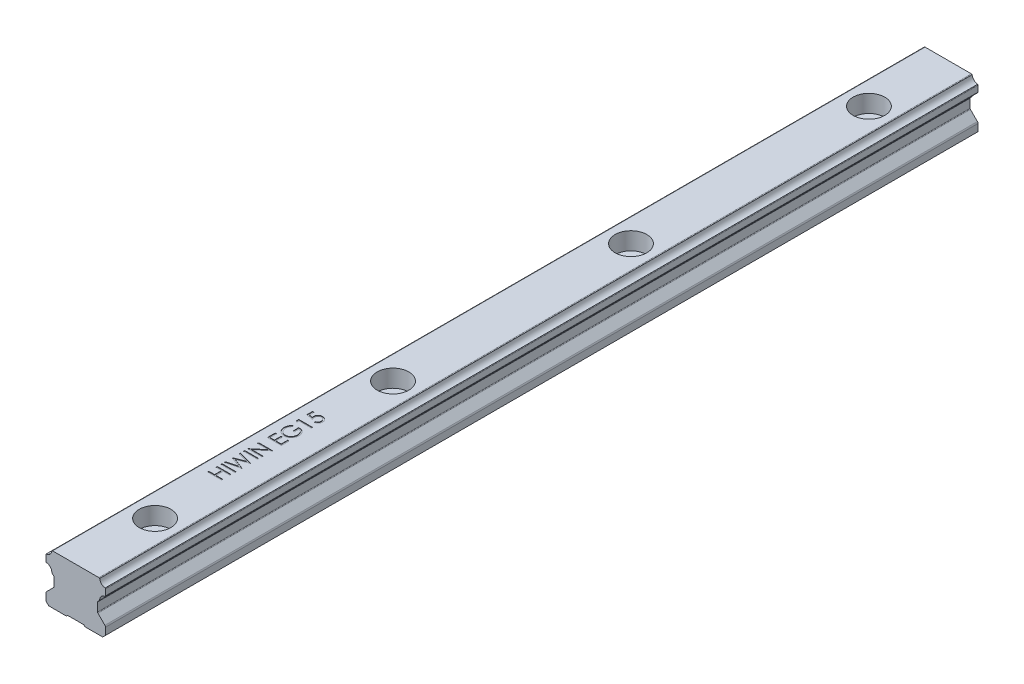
from build123d import *

# Parameters (mm, degrees)
EXTRUDE_1_DEPTH              = 220
HOLE_WIZARD_M4_1_D           = 4.5
HOLE_WIZARD_M4_1_CBORE_D     = 8
HOLE_WIZARD_M4_1_CBORE_DEPTH = 4.4
PATTERN_LINEAR_1_COUNT       = 4
PATTERN_LINEAR_1_PITCH       = 60
SKETCH_6_W                   = 3.5
SKETCH_6_H                   = 0.314102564
CUT_EXTRUDE_1_DEPTH          = 0.1


with BuildPart() as part:
    # Sketch 1 → Extrude 1 (new body)
    with BuildSketch(Plane.XY):
        with BuildLine():
            Line((7.5, 9.369442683), (7.5, 10.830565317))
            ThreePointArc((7.5, 10.830565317), (7.479698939, 10.939048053), (7.421543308, 11.032848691))
            ThreePointArc((7.421543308, 11.032848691), (6.468331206, 11.468335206), (6.03284469, 12.421547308))
            ThreePointArc((6.03284469, 12.421547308), (5.939044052, 12.479702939), (5.830561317, 12.500004))
            Line((5.830561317, 12.500004), (-5.830561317, 12.500004))
            ThreePointArc((-5.830561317, 12.500004), (-5.939044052, 12.479702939), (-6.03284469, 12.421547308))
            ThreePointArc((-6.03284469, 12.421547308), (-6.468331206, 11.468335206), (-7.421543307, 11.03284869))
            ThreePointArc((-7.421543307, 11.03284869), (-7.479698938, 10.939048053), (-7.5, 10.830565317))
            Line((-7.5, 10.830565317), (-7.5, 9.369442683))
            ThreePointArc((-7.5, 9.369442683), (-7.479698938, 9.260959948), (-7.421543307, 9.16715931))
            ThreePointArc((-7.421543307, 9.16715931), (-6.419021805, 8.6799564), (-6.029408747, 7.635629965))
            Line((-6.029408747, 7.635629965), (-5.58786755, 7.194087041))
            ThreePointArc((-5.58786755, 7.194087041), (-5.522836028, 7.09676018), (-5.5, 6.981955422))
            Line((-5.5, 6.981955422), (-5.5, 4.824263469))
            ThreePointArc((-5.5, 4.824263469), (-5.52283614, 4.709458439), (-5.587867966, 4.612131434))
            Line((-5.587867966, 4.612131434), (-7.353553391, 2.846446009))
            ThreePointArc((-7.353553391, 2.846446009), (-7.461939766, 2.684234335), (-7.5, 2.492892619))
            Line((-7.5, 2.492892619), (-7.5, 0.700010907))
            Line((-7.5, 0.700010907), (-6.79998907, 0))
            Line((-6.79998907, 0), (-2.3500088, 0))
            Line((-2.3500088, 0), (-2.05000999, 0.29999924))
            Line((-2.05000999, 0.29999924), (2.05000999, 0.29999924))
            Line((2.05000999, 0.29999924), (2.3500088, 0))
            Line((2.3500088, 0), (6.79998907, 0))
            Line((6.79998907, 0), (7.5, 0.700010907))
            Line((7.5, 0.700010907), (7.5, 2.492892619))
            ThreePointArc((7.5, 2.492892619), (7.461939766, 2.684234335), (7.353553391, 2.84644601))
            Line((7.353553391, 2.84644601), (5.587867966, 4.612131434))
            ThreePointArc((5.587867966, 4.612131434), (5.522836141, 4.709458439), (5.5, 4.824263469))
            Line((5.5, 4.824263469), (5.5, 6.981955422))
            ThreePointArc((5.5, 6.981955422), (5.522836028, 7.09676018), (5.587867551, 7.194087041))
            Line((5.587867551, 7.194087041), (6.029408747, 7.635629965))
            ThreePointArc((6.029408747, 7.635629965), (6.419021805, 8.6799564), (7.421543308, 9.16715931))
            ThreePointArc((7.421543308, 9.16715931), (7.479698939, 9.260959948), (7.5, 9.369442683))
        make_face()
    extrude(amount=-EXTRUDE_1_DEPTH)

    # Hole Wizard M4 _1 (through all)
    with Locations(Plane(origin=(1.396551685, 12.500004, 9.221659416), x_dir=(-1, 0, 0), z_dir=(0, 1, 0))):
        with Locations((1.396551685, -29.221659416)):
            hole_wizard_m4_1 = CounterBoreHole(HOLE_WIZARD_M4_1_D / 2, HOLE_WIZARD_M4_1_CBORE_D / 2, HOLE_WIZARD_M4_1_CBORE_DEPTH)

    # Pattern Linear 1: Hole Wizard M4 _1 ×4
    with Locations(*[(0, 0, -i * PATTERN_LINEAR_1_PITCH) for i in range(1, PATTERN_LINEAR_1_COUNT)]):
        add(hole_wizard_m4_1, mode=Mode.SUBTRACT)

    # Sketch 6 → Cut-Extrude 1 (cut)
    with BuildSketch(Plane(origin=(0, 12.500004, 0), x_dir=(1, 0, 0), z_dir=(0, 1, 0))):
        Polygon((-3.5, 36.762820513), (-3.5, 37.076923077), (-2.064102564, 37.076923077), (-2.064102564, 38.871794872), (-3.5, 38.871794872), (-3.5, 39.185897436), (0, 39.185897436), (0, 38.871794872), (-1.705128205, 38.871794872), (-1.705128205, 37.076923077), (0, 37.076923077), (0, 36.762820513), align=None)
        with Locations((-1.75, 40.240384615)):
            Rectangle(SKETCH_6_W, SKETCH_6_H)
        Polygon((-3.5, 40.935897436), (-3.5, 41.260516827), (-0.933193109, 41.945512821), (-3.5, 42.964242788), (-3.5, 43.009815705), (-0.950721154, 44.009615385), (-3.5, 44.698116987), (-3.5, 45.019230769), (0, 44.075520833), (0, 44.030649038), (-2.676883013, 42.977564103), (0, 41.911858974), (0, 41.866987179), align=None)
        with Locations((-1.75, 45.983974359)):
            Rectangle(SKETCH_6_W, SKETCH_6_H)
        Polygon((0, 46.903846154), (-3.5, 46.903846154), (-3.5, 46.969751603), (-0.745292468, 49.282051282), (-3.5, 49.282051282), (-3.5, 49.596153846), (0, 49.596153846), (0, 49.524639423), (-2.748397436, 47.217948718), (0, 47.217948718), align=None)
        Polygon((-3.5, 51.83974359), (-3.5, 53.814102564), (-3.141025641, 53.814102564), (-3.141025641, 52.153846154), (-2.064102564, 52.153846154), (-2.064102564, 53.814102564), (-1.705128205, 53.814102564), (-1.705128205, 52.153846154), (-0.358974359, 52.153846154), (-0.358974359, 53.814102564), (0, 53.814102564), (0, 51.83974359), align=None)
        with BuildLine():
            Line((-2.902644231, 57.717948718), (-2.647435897, 57.448717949))
            add(Edge.make_bspline(
                [(-2.647435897, 57.448717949), (-2.69328212, 57.400008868), (-2.783881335, 57.303752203), (-2.901244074, 57.146552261), (-3.002777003, 56.983196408), (-3.084772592, 56.813420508), (-3.149094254, 56.641676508), (-3.195850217, 56.470917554), (-3.225460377, 56.302249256), (-3.229016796, 56.190084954), (-3.230769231, 56.134815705)],
                knots=[0, 0, 0, 0, 1.089067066, 2.152164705, 3.18986567, 4.218445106, 5.218487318, 6.173592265, 7.100032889, 8, 8, 8, 8], degree=3))
            add(Edge.make_bspline(
                [(-3.230769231, 56.134815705), (-3.230355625, 56.100901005), (-3.229529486, 56.033159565), (-3.218985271, 55.932537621), (-3.203820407, 55.832970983), (-3.181878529, 55.734647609), (-3.15406947, 55.637376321), (-3.119284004, 55.541495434), (-3.078728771, 55.446826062), (-3.031866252, 55.354260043), (-2.980386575, 55.26451931), (-2.923337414, 55.179763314), (-2.862550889, 55.099446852), (-2.796491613, 55.025097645), (-2.725807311, 54.956221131), (-2.651770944, 54.89155043), (-2.572926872, 54.832290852), (-2.489599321, 54.779505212), (-2.403726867, 54.731837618), (-2.316037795, 54.690645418), (-2.227346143, 54.654835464), (-2.136984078, 54.627561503), (-2.045883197, 54.604460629), (-1.953566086, 54.588379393), (-1.859791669, 54.579283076), (-1.796993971, 54.577712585), (-1.765424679, 54.576923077)],
                knots=[0, 0, 0, 0, 1.028150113, 2.053633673, 3.06513288, 4.081487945, 5.106702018, 6.131327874, 7.172780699, 8.228344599, 9.276313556, 10.308389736, 11.324843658, 12.329040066, 13.321460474, 14.316307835, 15.308626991, 16.309440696, 17.305625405, 18.28535951, 19.246194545, 20.203493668, 21.145557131, 22.095268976, 23.042464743, 24, 24, 24, 24], degree=3))
            add(Edge.make_bspline(
                [(-1.765424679, 54.576923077), (-1.733154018, 54.577679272), (-1.668700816, 54.579189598), (-1.572504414, 54.588842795), (-1.477747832, 54.606798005), (-1.384282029, 54.630609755), (-1.291920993, 54.66088243), (-1.20076111, 54.698074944), (-1.110811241, 54.742381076), (-1.022964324, 54.793552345), (-0.937464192, 54.850061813), (-0.856251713, 54.912212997), (-0.780271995, 54.980110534), (-0.708415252, 55.052509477), (-0.641134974, 55.130069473), (-0.579242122, 55.213543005), (-0.521779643, 55.301761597), (-0.469378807, 55.394764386), (-0.42257144, 55.491568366), (-0.38094723, 55.590824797), (-0.346667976, 55.692852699), (-0.31872985, 55.797115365), (-0.295829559, 55.903488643), (-0.281097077, 56.012512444), (-0.270406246, 56.123385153), (-0.269624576, 56.198123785), (-0.269230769, 56.235777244)],
                knots=[0, 0, 0, 0, 0.935915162, 1.869274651, 2.799799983, 3.730201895, 4.664668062, 5.616159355, 6.583070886, 7.570012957, 8.562524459, 9.553461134, 10.53281078, 11.515274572, 12.509912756, 13.507571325, 14.526460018, 15.561318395, 16.601025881, 17.643204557, 18.680545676, 19.719612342, 20.772381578, 21.833430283, 22.908478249, 24, 24, 24, 24], degree=3))
            add(Edge.make_bspline(
                [(-0.269230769, 56.235777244), (-0.270178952, 56.281155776), (-0.272040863, 56.370263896), (-0.286546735, 56.501247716), (-0.309173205, 56.627060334), (-0.342412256, 56.747292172), (-0.384484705, 56.862379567), (-0.436513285, 56.971898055), (-0.497950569, 57.076150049), (-0.567552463, 57.174684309), (-0.645100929, 57.26515833), (-0.728035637, 57.347500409), (-0.817431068, 57.418879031), (-0.911954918, 57.481426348), (-1.012511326, 57.533123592), (-1.118540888, 57.57556947), (-1.230109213, 57.608101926), (-1.307200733, 57.621457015), (-1.346153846, 57.628205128)],
                knots=[0, 0, 0, 0, 1.130199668, 2.219330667, 3.279027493, 4.311506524, 5.322739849, 6.327972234, 7.327472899, 8.33386792, 9.329086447, 10.29244429, 11.240784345, 12.174119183, 13.111530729, 14.052100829, 15.015757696, 16, 16, 16, 16], degree=3))
            Line((-1.346153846, 57.628205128), (-1.346153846, 56.461538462))
            Line((-1.346153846, 56.461538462), (-1.705128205, 56.461538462))
            Line((-1.705128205, 56.461538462), (-1.705128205, 57.942307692))
            add(Edge.make_bspline(
                [(-1.705128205, 57.942307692), (-1.638220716, 57.940601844), (-1.507270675, 57.937263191), (-1.316300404, 57.913844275), (-1.13592871, 57.876027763), (-0.965965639, 57.824367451), (-0.806652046, 57.75749217), (-0.65782618, 57.676119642), (-0.520449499, 57.578947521), (-0.393400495, 57.469437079), (-0.280071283, 57.346537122), (-0.180465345, 57.213568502), (-0.09656273, 57.070311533), (-0.028302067, 56.916901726), (0.024971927, 56.753841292), (0.062743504, 56.580752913), (0.085373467, 56.397871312), (0.088264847, 56.272534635), (0.08974359, 56.208433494)],
                knots=[0, 0, 0, 0, 1.140356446, 2.231883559, 3.274166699, 4.278491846, 5.25512956, 6.21435461, 7.1637429, 8.11826594, 9.068280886, 10.0076534, 10.945064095, 11.891975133, 12.864533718, 13.863980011, 14.907571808, 16, 16, 16, 16], degree=3))
            add(Edge.make_bspline(
                [(0.08974359, 56.208433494), (0.089174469, 56.168923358), (0.088051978, 56.090996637), (0.080074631, 55.975905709), (0.067794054, 55.863988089), (0.049248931, 55.75526008), (0.026534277, 55.649321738), (-0.002552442, 55.546702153), (-0.036221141, 55.447010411), (-0.074516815, 55.350092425), (-0.118888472, 55.256827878), (-0.168198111, 55.166801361), (-0.222191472, 55.079515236), (-0.281802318, 54.995564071), (-0.346584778, 54.914510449), (-0.416668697, 54.836877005), (-0.491839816, 54.762229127), (-0.545218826, 54.715468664), (-0.572115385, 54.691907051)],
                knots=[0, 0, 0, 0, 1.107784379, 2.184907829, 3.233506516, 4.263428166, 5.276301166, 6.270063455, 7.25232949, 8.225834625, 9.190232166, 10.146266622, 11.1027726, 12.066435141, 13.031522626, 14.010570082, 14.99756817, 16, 16, 16, 16], degree=3))
            add(Edge.make_bspline(
                [(-0.572115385, 54.691907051), (-0.614786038, 54.657721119), (-0.699419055, 54.589916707), (-0.835018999, 54.50263855), (-0.975420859, 54.428237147), (-1.121015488, 54.367869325), (-1.271666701, 54.320731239), (-1.427181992, 54.286924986), (-1.587761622, 54.267117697), (-1.696426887, 54.264264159), (-1.751402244, 54.262820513)],
                knots=[0, 0, 0, 0, 1.023165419, 2.029347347, 3.013907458, 3.994755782, 4.975994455, 5.96558838, 6.970761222, 8, 8, 8, 8], degree=3))
            add(Edge.make_bspline(
                [(-1.751402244, 54.262820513), (-1.792568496, 54.263352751), (-1.874377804, 54.264410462), (-1.99583511, 54.27723598), (-2.115135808, 54.295637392), (-2.232182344, 54.322684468), (-2.347053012, 54.356780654), (-2.45980069, 54.399334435), (-2.570493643, 54.448878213), (-2.67836343, 54.50646793), (-2.782003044, 54.570536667), (-2.880905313, 54.640144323), (-2.973467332, 54.715828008), (-3.059903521, 54.797808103), (-3.141494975, 54.884432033), (-3.216537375, 54.977518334), (-3.286205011, 55.07565667), (-3.349159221, 55.17960781), (-3.405727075, 55.287731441), (-3.455315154, 55.399792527), (-3.496298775, 55.515750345), (-3.531072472, 55.634737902), (-3.556787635, 55.757655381), (-3.575436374, 55.883610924), (-3.588196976, 56.013261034), (-3.589223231, 56.100897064), (-3.58974359, 56.145332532)],
                knots=[0, 0, 0, 0, 1.00895651, 2.005089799, 2.991467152, 3.967318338, 4.948153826, 5.927364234, 6.919980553, 7.91976625, 8.923240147, 9.905815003, 10.88314567, 11.851989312, 12.825009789, 13.798721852, 14.781296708, 15.773896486, 16.776076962, 17.771600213, 18.775744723, 19.78957137, 20.808953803, 21.851964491, 22.910847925, 24, 24, 24, 24], degree=3))
            add(Edge.make_bspline(
                [(-3.58974359, 56.145332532), (-3.589164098, 56.181570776), (-3.588015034, 56.253426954), (-3.580050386, 56.360352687), (-3.567426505, 56.465625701), (-3.550199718, 56.569402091), (-3.526736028, 56.671328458), (-3.498657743, 56.771695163), (-3.46596592, 56.870647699), (-3.426977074, 56.967875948), (-3.382723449, 57.064033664), (-3.332910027, 57.159655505), (-3.276685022, 57.254414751), (-3.213881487, 57.348475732), (-3.145578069, 57.44243159), (-3.069821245, 57.534796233), (-2.989598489, 57.627799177), (-2.931916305, 57.687600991), (-2.902644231, 57.717948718)],
                knots=[0, 0, 0, 0, 0.985871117, 1.954866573, 2.915460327, 3.869826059, 4.81536089, 5.759505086, 6.70452669, 7.649098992, 8.607881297, 9.583363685, 10.581137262, 11.603961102, 12.659522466, 13.73993555, 14.853081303, 16, 16, 16, 16], degree=3))
        make_face()
        Polygon((-3.5, 59.090044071), (-3.5, 59.737179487), (0, 59.737179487), (0, 59.423076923), (-3.141025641, 59.423076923), (-3.141025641, 58.884615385), align=None)
        with BuildLine():
            Line((-3.5, 63.237179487), (-3.141025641, 63.237179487))
            Line((-3.141025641, 63.237179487), (-3.141025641, 62.046674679))
            Line((-3.141025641, 62.046674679), (-2.220452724, 61.858072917))
            add(Edge.make_bspline(
                [(-2.220452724, 61.858072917), (-2.230682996, 61.895128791), (-2.25050253, 61.966918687), (-2.2725083, 62.072878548), (-2.285773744, 62.173470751), (-2.287585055, 62.238746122), (-2.288461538, 62.270332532)],
                knots=[0, 0, 0, 0, 1.100273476, 2.13160584, 3.095893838, 4, 4, 4, 4], degree=3))
            add(Edge.make_bspline(
                [(-2.288461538, 62.270332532), (-2.28764354, 62.309423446), (-2.28603515, 62.38628595), (-2.269673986, 62.498570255), (-2.245976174, 62.606297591), (-2.209465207, 62.707877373), (-2.164878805, 62.804916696), (-2.108721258, 62.895749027), (-2.04315746, 62.981649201), (-1.968525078, 63.06202352), (-1.885534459, 63.134596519), (-1.795933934, 63.197660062), (-1.701678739, 63.252702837), (-1.600559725, 63.295631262), (-1.494484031, 63.330665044), (-1.382227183, 63.353766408), (-1.264785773, 63.369197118), (-1.18448027, 63.370917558), (-1.143529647, 63.371794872)],
                knots=[0, 0, 0, 0, 1.052805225, 2.070078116, 3.052532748, 4.020689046, 4.973125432, 5.925915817, 6.89216474, 7.881560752, 8.877013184, 9.857446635, 10.830895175, 11.812622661, 12.812548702, 13.836681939, 14.896847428, 16, 16, 16, 16], degree=3))
            add(Edge.make_bspline(
                [(-1.143529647, 63.371794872), (-1.115007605, 63.371129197), (-1.058348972, 63.369806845), (-0.974202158, 63.363097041), (-0.891849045, 63.350128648), (-0.811440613, 63.332928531), (-0.732901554, 63.309967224), (-0.65579213, 63.283109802), (-0.580956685, 63.249727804), (-0.508064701, 63.21272013), (-0.437950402, 63.171741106), (-0.372294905, 63.125661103), (-0.309599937, 63.077781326), (-0.251727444, 63.02546383), (-0.198452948, 62.969303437), (-0.149513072, 62.909612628), (-0.104029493, 62.846932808), (-0.063861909, 62.780276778), (-0.026898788, 62.711134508), (0.003424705, 62.638506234), (0.030535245, 62.564045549), (0.05214477, 62.486680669), (0.069077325, 62.406586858), (0.080577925, 62.323632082), (0.088954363, 62.238251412), (0.08947872, 62.180376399), (0.08974359, 62.151141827)],
                knots=[0, 0, 0, 0, 1.056393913, 2.098511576, 3.122979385, 4.141471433, 5.141222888, 6.151259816, 7.162667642, 8.172852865, 9.177685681, 10.166741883, 11.141342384, 12.097242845, 13.052202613, 14.005160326, 14.953864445, 15.917140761, 16.884916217, 17.854238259, 18.828761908, 19.81781811, 20.826036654, 21.857789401, 22.917898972, 24, 24, 24, 24], degree=3))
            add(Edge.make_bspline(
                [(0.08974359, 62.151141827), (0.089050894, 62.116268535), (0.087688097, 62.047659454), (0.073496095, 61.947126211), (0.053035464, 61.850457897), (0.022721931, 61.758068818), (-0.016971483, 61.670344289), (-0.064133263, 61.586028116), (-0.12027864, 61.506165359), (-0.184894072, 61.431302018), (-0.255892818, 61.362486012), (-0.332202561, 61.300083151), (-0.413920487, 61.245219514), (-0.500780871, 61.197696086), (-0.592629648, 61.157210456), (-0.689749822, 61.12539205), (-0.791650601, 61.099714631), (-0.861804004, 61.088851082), (-0.897435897, 61.083333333)],
                knots=[0, 0, 0, 0, 1.046872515, 2.059598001, 3.044168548, 4.012104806, 4.973680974, 5.932408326, 6.910122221, 7.900780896, 8.89867654, 9.876692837, 10.858029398, 11.85084981, 12.847361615, 13.868568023, 14.917415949, 16, 16, 16, 16], degree=3))
            Line((-0.897435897, 61.083333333), (-0.897435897, 61.397435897))
            add(Edge.make_bspline(
                [(-0.897435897, 61.397435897), (-0.86405597, 61.40515962), (-0.799897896, 61.420005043), (-0.709812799, 61.452675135), (-0.62950762, 61.4922321), (-0.558491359, 61.540366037), (-0.495464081, 61.596159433), (-0.43989307, 61.661016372), (-0.389697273, 61.733315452), (-0.347784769, 61.813697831), (-0.312479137, 61.898665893), (-0.287283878, 61.987088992), (-0.272032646, 62.077694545), (-0.270168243, 62.138697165), (-0.269230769, 62.169370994)],
                knots=[0, 0, 0, 0, 1.13623081, 2.183898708, 3.172478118, 4.09966615, 5.022692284, 5.957376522, 6.927682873, 7.937366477, 8.960015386, 9.976409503, 10.982481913, 12, 12, 12, 12], degree=3))
            add(Edge.make_bspline(
                [(-0.269230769, 62.169370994), (-0.270058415, 62.199326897), (-0.271688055, 62.258310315), (-0.284028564, 62.345158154), (-0.303533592, 62.428761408), (-0.33085902, 62.509268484), (-0.367008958, 62.586283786), (-0.411417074, 62.659698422), (-0.462975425, 62.730558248), (-0.521904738, 62.796998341), (-0.586881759, 62.857834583), (-0.656357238, 62.911591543), (-0.730474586, 62.956368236), (-0.807947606, 62.994102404), (-0.889626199, 63.022755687), (-0.975127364, 63.043196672), (-1.064662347, 63.05519973), (-1.125731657, 63.05685091), (-1.156850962, 63.057692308)],
                knots=[0, 0, 0, 0, 1.027268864, 2.022700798, 3.002744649, 3.968653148, 4.933396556, 5.915045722, 6.907600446, 7.935526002, 8.956456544, 9.95700807, 10.942805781, 11.92166854, 12.907987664, 13.905483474, 14.932689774, 16, 16, 16, 16], degree=3))
            add(Edge.make_bspline(
                [(-1.156850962, 63.057692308), (-1.184930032, 63.057053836), (-1.239659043, 63.055809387), (-1.320009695, 63.045036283), (-1.396158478, 63.027039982), (-1.468436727, 63.001416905), (-1.536613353, 62.969438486), (-1.600538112, 62.929288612), (-1.660812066, 62.882676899), (-1.715884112, 62.82825878), (-1.766793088, 62.769063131), (-1.810034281, 62.703569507), (-1.846807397, 62.633526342), (-1.876936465, 62.558803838), (-1.900936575, 62.479309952), (-1.917523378, 62.395001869), (-1.92744867, 62.305860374), (-1.928795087, 62.24488473), (-1.929487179, 62.213541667)],
                knots=[0, 0, 0, 0, 1.045723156, 2.038222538, 3.013889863, 3.95567481, 4.890389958, 5.81331128, 6.76251276, 7.723027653, 8.692928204, 9.666105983, 10.639751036, 11.635719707, 12.66315958, 13.728667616, 14.832476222, 16, 16, 16, 16], degree=3))
            add(Edge.make_bspline(
                [(-1.929487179, 62.213541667), (-1.928906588, 62.186412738), (-1.927707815, 62.130398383), (-1.918881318, 62.044475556), (-1.904642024, 61.954183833), (-1.885055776, 61.859869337), (-1.859424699, 61.761248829), (-1.828710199, 61.658530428), (-1.7919882, 61.551498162), (-1.764255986, 61.479380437), (-1.75, 61.442307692)],
                knots=[0, 0, 0, 0, 0.817624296, 1.688186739, 2.600797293, 3.572016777, 4.590301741, 5.671205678, 6.80286297, 8, 8, 8, 8], degree=3))
            Line((-1.75, 61.442307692), (-3.5, 61.801282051))
            Line((-3.5, 61.801282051), (-3.5, 63.237179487))
        make_face()
    extrude(amount=-CUT_EXTRUDE_1_DEPTH, mode=Mode.SUBTRACT)


solid = part.part
